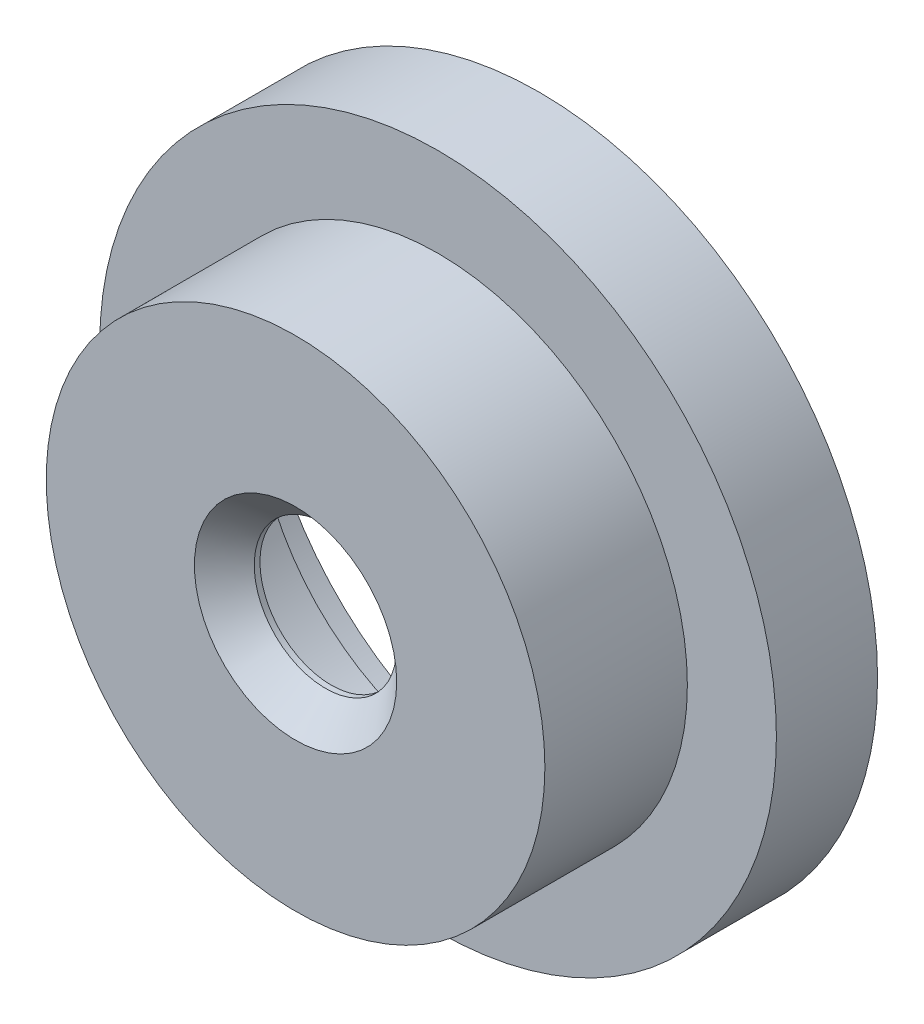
ISO-10303-21;
HEADER;
FILE_DESCRIPTION(('STEP AP214'),'2;1');
FILE_NAME('part.step','',(''),(''),'','','');
FILE_SCHEMA(('AUTOMOTIVE_DESIGN { 1 0 10303 214 1 1 1 1 }'));
ENDSEC;
DATA;
#1=APPLICATION_CONTEXT('core data for automotive mechanical design processes');
#2=APPLICATION_PROTOCOL_DEFINITION('international standard','automotive_design',2000,#1);
#3=PRODUCT_CONTEXT('',#1,'mechanical');
#4=PRODUCT('Part','Part','',(#3));
#5=PRODUCT_RELATED_PRODUCT_CATEGORY('part','',(#4));
#6=PRODUCT_DEFINITION_FORMATION('','',#4);
#7=PRODUCT_DEFINITION_CONTEXT('part definition',#1,'design');
#8=PRODUCT_DEFINITION('design','',#6,#7);
#9=PRODUCT_DEFINITION_SHAPE('','',#8);
#10=(LENGTH_UNIT() NAMED_UNIT(*) SI_UNIT(.MILLI.,.METRE.));
#11=(NAMED_UNIT(*) PLANE_ANGLE_UNIT() SI_UNIT($,.RADIAN.));
#12=(NAMED_UNIT(*) SI_UNIT($,.STERADIAN.) SOLID_ANGLE_UNIT());
#13=UNCERTAINTY_MEASURE_WITH_UNIT(LENGTH_MEASURE(1.E-05),#10,'distance_accuracy_value','');
#14=(GEOMETRIC_REPRESENTATION_CONTEXT(3) GLOBAL_UNCERTAINTY_ASSIGNED_CONTEXT((#13)) GLOBAL_UNIT_ASSIGNED_CONTEXT((#10,
#11,#12)) REPRESENTATION_CONTEXT('',''));
#15=CARTESIAN_POINT('',(0.,0.,0.));
#16=DIRECTION('',(0.,0.,1.));
#17=DIRECTION('',(1.,0.,0.));
#18=AXIS2_PLACEMENT_3D('',#15,#16,#17);
#19=CARTESIAN_POINT('',(0.,0.,-12.7));
#20=DIRECTION('',(0.,0.,1.));
#21=DIRECTION('',(1.,0.,0.));
#22=AXIS2_PLACEMENT_3D('',#19,#20,#21);
#23=CYLINDRICAL_SURFACE('',#22,22.225);
#24=CARTESIAN_POINT('',(0.,0.,-12.7));
#25=DIRECTION('',(0.,0.,-1.));
#26=DIRECTION('',(-1.,0.,0.));
#27=AXIS2_PLACEMENT_3D('',#24,#25,#26);
#28=CIRCLE('',#27,22.225);
#29=CARTESIAN_POINT('',(-22.225,0.,-12.7));
#30=VERTEX_POINT('',#29);
#31=EDGE_CURVE('E108',#30,#30,#28,.F.);
#32=ORIENTED_EDGE('',*,*,#31,.T.);
#33=EDGE_LOOP('',(#32));
#34=FACE_BOUND('',#33,.T.);
#35=CARTESIAN_POINT('',(0.,0.,0.));
#36=DIRECTION('',(0.,0.,1.));
#37=DIRECTION('',(1.,0.,0.));
#38=AXIS2_PLACEMENT_3D('',#35,#36,#37);
#39=CIRCLE('',#38,22.225);
#40=CARTESIAN_POINT('',(22.225,0.,0.));
#41=VERTEX_POINT('',#40);
#42=EDGE_CURVE('E113',#41,#41,#39,.T.);
#43=ORIENTED_EDGE('',*,*,#42,.F.);
#44=EDGE_LOOP('',(#43));
#45=FACE_BOUND('',#44,.T.);
#46=ADVANCED_FACE('F37',(#34,#45),#23,.T.);
#47=CARTESIAN_POINT('',(0.,0.,0.));
#48=DIRECTION('',(0.,0.,1.));
#49=DIRECTION('',(1.,0.,0.));
#50=AXIS2_PLACEMENT_3D('',#47,#48,#49);
#51=PLANE('',#50);
#52=CARTESIAN_POINT('',(0.,0.,0.));
#53=DIRECTION('',(0.,0.,1.));
#54=DIRECTION('',(1.,0.,0.));
#55=AXIS2_PLACEMENT_3D('',#52,#53,#54);
#56=CIRCLE('',#55,9.017);
#57=CARTESIAN_POINT('',(9.017,0.,0.));
#58=VERTEX_POINT('',#57);
#59=EDGE_CURVE('E11',#58,#58,#56,.F.);
#60=ORIENTED_EDGE('',*,*,#59,.T.);
#61=EDGE_LOOP('',(#60));
#62=FACE_BOUND('',#61,.T.);
#63=ORIENTED_EDGE('',*,*,#42,.T.);
#64=EDGE_LOOP('',(#63));
#65=FACE_BOUND('',#64,.T.);
#66=ADVANCED_FACE('F136',(#62,#65),#51,.T.);
#67=CARTESIAN_POINT('',(0.,0.,-21.717));
#68=DIRECTION('',(0.,0.,1.));
#69=DIRECTION('',(1.,0.,0.));
#70=AXIS2_PLACEMENT_3D('',#67,#68,#69);
#71=CYLINDRICAL_SURFACE('',#70,30.1625);
#72=CARTESIAN_POINT('',(0.,0.,-21.717));
#73=DIRECTION('',(0.,0.,-1.));
#74=DIRECTION('',(-1.,0.,0.));
#75=AXIS2_PLACEMENT_3D('',#72,#73,#74);
#76=CIRCLE('',#75,30.1625);
#77=CARTESIAN_POINT('',(-30.1625,0.,-21.717));
#78=VERTEX_POINT('',#77);
#79=EDGE_CURVE('E105',#78,#78,#76,.T.);
#80=ORIENTED_EDGE('',*,*,#79,.F.);
#81=EDGE_LOOP('',(#80));
#82=FACE_BOUND('',#81,.T.);
#83=CARTESIAN_POINT('',(0.,0.,-12.7));
#84=DIRECTION('',(0.,0.,-1.));
#85=DIRECTION('',(-1.,0.,0.));
#86=AXIS2_PLACEMENT_3D('',#83,#84,#85);
#87=CIRCLE('',#86,30.1625);
#88=CARTESIAN_POINT('',(-30.1625,0.,-12.7));
#89=VERTEX_POINT('',#88);
#90=EDGE_CURVE('E102',#89,#89,#87,.T.);
#91=ORIENTED_EDGE('',*,*,#90,.T.);
#92=EDGE_LOOP('',(#91));
#93=FACE_BOUND('',#92,.T.);
#94=ADVANCED_FACE('F141',(#82,#93),#71,.T.);
#95=CARTESIAN_POINT('',(0.,0.,-21.717));
#96=DIRECTION('',(0.,0.,-1.));
#97=DIRECTION('',(-1.,0.,0.));
#98=AXIS2_PLACEMENT_3D('',#95,#96,#97);
#99=PLANE('',#98);
#100=CARTESIAN_POINT('',(0.,27.7114,-21.717));
#101=DIRECTION('',(0.,0.,-1.));
#102=DIRECTION('',(-1.,0.,0.));
#103=AXIS2_PLACEMENT_3D('',#100,#101,#102);
#104=CIRCLE('',#103,1.1303);
#105=CARTESIAN_POINT('',(-1.1303,27.7114,-21.717));
#106=VERTEX_POINT('',#105);
#107=EDGE_CURVE('E69',#106,#106,#104,.T.);
#108=ORIENTED_EDGE('',*,*,#107,.F.);
#109=EDGE_LOOP('',(#108));
#110=FACE_BOUND('',#109,.T.);
#111=CARTESIAN_POINT('',(-27.7114,0.,-21.717));
#112=DIRECTION('',(0.,0.,-1.));
#113=DIRECTION('',(-1.,0.,0.));
#114=AXIS2_PLACEMENT_3D('',#111,#112,#113);
#115=CIRCLE('',#114,1.1303);
#116=CARTESIAN_POINT('',(-28.8417,0.,-21.717));
#117=VERTEX_POINT('',#116);
#118=EDGE_CURVE('E68',#117,#117,#115,.T.);
#119=ORIENTED_EDGE('',*,*,#118,.F.);
#120=EDGE_LOOP('',(#119));
#121=FACE_BOUND('',#120,.T.);
#122=CARTESIAN_POINT('',(0.,-27.7114,-21.717));
#123=DIRECTION('',(0.,0.,-1.));
#124=DIRECTION('',(-1.,0.,0.));
#125=AXIS2_PLACEMENT_3D('',#122,#123,#124);
#126=CIRCLE('',#125,1.1303);
#127=CARTESIAN_POINT('',(-1.1303,-27.7114,-21.717));
#128=VERTEX_POINT('',#127);
#129=EDGE_CURVE('E79',#128,#128,#126,.T.);
#130=ORIENTED_EDGE('',*,*,#129,.F.);
#131=EDGE_LOOP('',(#130));
#132=FACE_BOUND('',#131,.T.);
#133=CARTESIAN_POINT('',(27.7114,0.,-21.717));
#134=DIRECTION('',(0.,0.,-1.));
#135=DIRECTION('',(-1.,0.,0.));
#136=AXIS2_PLACEMENT_3D('',#133,#134,#135);
#137=CIRCLE('',#136,1.1303);
#138=CARTESIAN_POINT('',(26.5811,0.,-21.717));
#139=VERTEX_POINT('',#138);
#140=EDGE_CURVE('E85',#139,#139,#137,.T.);
#141=ORIENTED_EDGE('',*,*,#140,.F.);
#142=EDGE_LOOP('',(#141));
#143=FACE_BOUND('',#142,.T.);
#144=CARTESIAN_POINT('',(0.,0.,-21.717));
#145=DIRECTION('',(0.,0.,-1.));
#146=DIRECTION('',(-1.,0.,0.));
#147=AXIS2_PLACEMENT_3D('',#144,#145,#146);
#148=CIRCLE('',#147,25.273);
#149=CARTESIAN_POINT('',(-25.273,0.,-21.717));
#150=VERTEX_POINT('',#149);
#151=EDGE_CURVE('E95',#150,#150,#148,.T.);
#152=ORIENTED_EDGE('',*,*,#151,.F.);
#153=EDGE_LOOP('',(#152));
#154=FACE_BOUND('',#153,.T.);
#155=ORIENTED_EDGE('',*,*,#79,.T.);
#156=EDGE_LOOP('',(#155));
#157=FACE_BOUND('',#156,.T.);
#158=ADVANCED_FACE('F148',(#110,#121,#132,#143,#154,#157),#99,.T.);
#159=CARTESIAN_POINT('',(0.,0.,-12.7));
#160=DIRECTION('',(0.,0.,-1.));
#161=DIRECTION('',(-1.,0.,0.));
#162=AXIS2_PLACEMENT_3D('',#159,#160,#161);
#163=PLANE('',#162);
#164=ORIENTED_EDGE('',*,*,#31,.F.);
#165=EDGE_LOOP('',(#164));
#166=FACE_BOUND('',#165,.T.);
#167=ORIENTED_EDGE('',*,*,#90,.F.);
#168=EDGE_LOOP('',(#167));
#169=FACE_BOUND('',#168,.T.);
#170=ADVANCED_FACE('F150',(#166,#169),#163,.F.);
#171=CARTESIAN_POINT('',(0.,0.,-15.875));
#172=DIRECTION('',(0.,0.,-1.));
#173=DIRECTION('',(-1.,0.,0.));
#174=AXIS2_PLACEMENT_3D('',#171,#172,#173);
#175=CYLINDRICAL_SURFACE('',#174,25.273);
#176=CARTESIAN_POINT('',(0.,0.,-15.875));
#177=DIRECTION('',(0.,0.,-1.));
#178=DIRECTION('',(-1.,0.,0.));
#179=AXIS2_PLACEMENT_3D('',#176,#177,#178);
#180=CIRCLE('',#179,25.273);
#181=CARTESIAN_POINT('',(-25.273,0.,-15.875));
#182=VERTEX_POINT('',#181);
#183=EDGE_CURVE('E99',#182,#182,#180,.T.);
#184=ORIENTED_EDGE('',*,*,#183,.F.);
#185=EDGE_LOOP('',(#184));
#186=FACE_BOUND('',#185,.T.);
#187=ORIENTED_EDGE('',*,*,#151,.T.);
#188=EDGE_LOOP('',(#187));
#189=FACE_BOUND('',#188,.T.);
#190=ADVANCED_FACE('F153',(#186,#189),#175,.F.);
#191=CARTESIAN_POINT('',(0.,0.,-15.875));
#192=DIRECTION('',(0.,0.,-1.));
#193=DIRECTION('',(-1.,0.,0.));
#194=AXIS2_PLACEMENT_3D('',#191,#192,#193);
#195=PLANE('',#194);
#196=CARTESIAN_POINT('',(0.,0.,-15.875));
#197=DIRECTION('',(0.,0.,-1.));
#198=DIRECTION('',(-1.,0.,0.));
#199=AXIS2_PLACEMENT_3D('',#196,#197,#198);
#200=CIRCLE('',#199,19.431);
#201=CARTESIAN_POINT('',(-19.431,0.,-15.875));
#202=VERTEX_POINT('',#201);
#203=EDGE_CURVE('E96',#202,#202,#200,.T.);
#204=ORIENTED_EDGE('',*,*,#203,.F.);
#205=EDGE_LOOP('',(#204));
#206=FACE_BOUND('',#205,.T.);
#207=ORIENTED_EDGE('',*,*,#183,.T.);
#208=EDGE_LOOP('',(#207));
#209=FACE_BOUND('',#208,.T.);
#210=ADVANCED_FACE('F160',(#206,#209),#195,.T.);
#211=CARTESIAN_POINT('',(0.,0.,-3.175));
#212=DIRECTION('',(0.,0.,-1.));
#213=DIRECTION('',(-1.,0.,0.));
#214=AXIS2_PLACEMENT_3D('',#211,#212,#213);
#215=CYLINDRICAL_SURFACE('',#214,19.431);
#216=CARTESIAN_POINT('',(0.,0.,-3.175));
#217=DIRECTION('',(0.,0.,-1.));
#218=DIRECTION('',(-1.,0.,0.));
#219=AXIS2_PLACEMENT_3D('',#216,#217,#218);
#220=CIRCLE('',#219,19.431);
#221=CARTESIAN_POINT('',(-19.431,0.,-3.175));
#222=VERTEX_POINT('',#221);
#223=EDGE_CURVE('E92',#222,#222,#220,.T.);
#224=ORIENTED_EDGE('',*,*,#223,.F.);
#225=EDGE_LOOP('',(#224));
#226=FACE_BOUND('',#225,.T.);
#227=ORIENTED_EDGE('',*,*,#203,.T.);
#228=EDGE_LOOP('',(#227));
#229=FACE_BOUND('',#228,.T.);
#230=ADVANCED_FACE('F164',(#226,#229),#215,.F.);
#231=CARTESIAN_POINT('',(0.,0.,-3.175));
#232=DIRECTION('',(0.,0.,-1.));
#233=DIRECTION('',(-1.,0.,0.));
#234=AXIS2_PLACEMENT_3D('',#231,#232,#233);
#235=PLANE('',#234);
#236=CARTESIAN_POINT('',(0.,0.,-3.175));
#237=DIRECTION('',(0.,0.,-1.));
#238=DIRECTION('',(-1.,0.,0.));
#239=AXIS2_PLACEMENT_3D('',#236,#237,#238);
#240=CIRCLE('',#239,6.34999999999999);
#241=CARTESIAN_POINT('',(-6.34999999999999,0.,-3.175));
#242=VERTEX_POINT('',#241);
#243=EDGE_CURVE('E91',#242,#242,#240,.T.);
#244=ORIENTED_EDGE('',*,*,#243,.F.);
#245=EDGE_LOOP('',(#244));
#246=FACE_BOUND('',#245,.T.);
#247=ORIENTED_EDGE('',*,*,#223,.T.);
#248=EDGE_LOOP('',(#247));
#249=FACE_BOUND('',#248,.T.);
#250=ADVANCED_FACE('F132',(#246,#249),#235,.T.);
#251=CARTESIAN_POINT('',(0.,0.,0.));
#252=DIRECTION('',(0.,0.,1.));
#253=DIRECTION('',(1.,0.,0.));
#254=AXIS2_PLACEMENT_3D('',#251,#252,#253);
#255=CYLINDRICAL_SURFACE('',#254,6.34999999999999);
#256=CARTESIAN_POINT('',(0.,0.,-2.66700000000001));
#257=DIRECTION('',(0.,0.,1.));
#258=DIRECTION('',(1.,0.,0.));
#259=AXIS2_PLACEMENT_3D('',#256,#257,#258);
#260=CIRCLE('',#259,6.34999999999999);
#261=CARTESIAN_POINT('',(6.34999999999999,0.,-2.66700000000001));
#262=VERTEX_POINT('',#261);
#263=EDGE_CURVE('E45',#262,#262,#260,.T.);
#264=ORIENTED_EDGE('',*,*,#263,.T.);
#265=EDGE_LOOP('',(#264));
#266=FACE_BOUND('',#265,.T.);
#267=ORIENTED_EDGE('',*,*,#243,.T.);
#268=EDGE_LOOP('',(#267));
#269=FACE_BOUND('',#268,.T.);
#270=ADVANCED_FACE('F120',(#266,#269),#255,.F.);
#271=CARTESIAN_POINT('',(0.,0.,-2.66700000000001));
#272=DIRECTION('',(0.,0.,1.));
#273=DIRECTION('',(1.,0.,0.));
#274=AXIS2_PLACEMENT_3D('',#271,#272,#273);
#275=CONICAL_SURFACE('',#274,6.34999999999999,0.785398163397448);
#276=ORIENTED_EDGE('',*,*,#59,.F.);
#277=EDGE_LOOP('',(#276));
#278=FACE_BOUND('',#277,.T.);
#279=ORIENTED_EDGE('',*,*,#263,.F.);
#280=EDGE_LOOP('',(#279));
#281=FACE_BOUND('',#280,.T.);
#282=ADVANCED_FACE('F39',(#278,#281),#275,.F.);
#283=CARTESIAN_POINT('',(27.7114,0.,-15.367));
#284=DIRECTION('',(0.,0.,-1.));
#285=DIRECTION('',(-1.,0.,0.));
#286=AXIS2_PLACEMENT_3D('',#283,#284,#285);
#287=CONICAL_SURFACE('',#286,1.1303,1.02974425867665);
#288=CARTESIAN_POINT('',(27.7114,0.,-14.6878472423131));
#289=VERTEX_POINT('',#288);
#290=VERTEX_LOOP('',#289);
#291=FACE_BOUND('',#290,.T.);
#292=CARTESIAN_POINT('',(27.7114,0.,-15.367));
#293=DIRECTION('',(0.,0.,-1.));
#294=DIRECTION('',(-1.,0.,0.));
#295=AXIS2_PLACEMENT_3D('',#292,#293,#294);
#296=CIRCLE('',#295,1.1303);
#297=CARTESIAN_POINT('',(26.5811,0.,-15.367));
#298=VERTEX_POINT('',#297);
#299=EDGE_CURVE('E88',#298,#298,#296,.T.);
#300=ORIENTED_EDGE('',*,*,#299,.T.);
#301=EDGE_LOOP('',(#300));
#302=FACE_BOUND('',#301,.T.);
#303=ADVANCED_FACE('F124',(#291,#302),#287,.F.);
#304=CARTESIAN_POINT('',(27.7114,0.,-21.717));
#305=DIRECTION('',(0.,0.,-1.));
#306=DIRECTION('',(-1.,0.,0.));
#307=AXIS2_PLACEMENT_3D('',#304,#305,#306);
#308=CYLINDRICAL_SURFACE('',#307,1.1303);
#309=ORIENTED_EDGE('',*,*,#299,.F.);
#310=EDGE_LOOP('',(#309));
#311=FACE_BOUND('',#310,.T.);
#312=ORIENTED_EDGE('',*,*,#140,.T.);
#313=EDGE_LOOP('',(#312));
#314=FACE_BOUND('',#313,.T.);
#315=ADVANCED_FACE('F130',(#311,#314),#308,.F.);
#316=CARTESIAN_POINT('',(0.,-27.7114,-15.367));
#317=DIRECTION('',(0.,0.,-1.));
#318=DIRECTION('',(-1.,0.,0.));
#319=AXIS2_PLACEMENT_3D('',#316,#317,#318);
#320=CONICAL_SURFACE('',#319,1.1303,1.02974425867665);
#321=CARTESIAN_POINT('',(0.,-27.7114,-14.6878472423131));
#322=VERTEX_POINT('',#321);
#323=VERTEX_LOOP('',#322);
#324=FACE_BOUND('',#323,.T.);
#325=CARTESIAN_POINT('',(0.,-27.7114,-15.367));
#326=DIRECTION('',(0.,0.,-1.));
#327=DIRECTION('',(-1.,0.,0.));
#328=AXIS2_PLACEMENT_3D('',#325,#326,#327);
#329=CIRCLE('',#328,1.1303);
#330=CARTESIAN_POINT('',(-1.1303,-27.7114,-15.367));
#331=VERTEX_POINT('',#330);
#332=EDGE_CURVE('E82',#331,#331,#329,.T.);
#333=ORIENTED_EDGE('',*,*,#332,.T.);
#334=EDGE_LOOP('',(#333));
#335=FACE_BOUND('',#334,.T.);
#336=ADVANCED_FACE('F174',(#324,#335),#320,.F.);
#337=CARTESIAN_POINT('',(0.,-27.7114,-21.717));
#338=DIRECTION('',(0.,0.,-1.));
#339=DIRECTION('',(-1.,0.,0.));
#340=AXIS2_PLACEMENT_3D('',#337,#338,#339);
#341=CYLINDRICAL_SURFACE('',#340,1.1303);
#342=ORIENTED_EDGE('',*,*,#332,.F.);
#343=EDGE_LOOP('',(#342));
#344=FACE_BOUND('',#343,.T.);
#345=ORIENTED_EDGE('',*,*,#129,.T.);
#346=EDGE_LOOP('',(#345));
#347=FACE_BOUND('',#346,.T.);
#348=ADVANCED_FACE('F178',(#344,#347),#341,.F.);
#349=CARTESIAN_POINT('',(-27.7114,0.,-15.367));
#350=DIRECTION('',(0.,0.,-1.));
#351=DIRECTION('',(-1.,0.,0.));
#352=AXIS2_PLACEMENT_3D('',#349,#350,#351);
#353=CONICAL_SURFACE('',#352,1.1303,1.02974425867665);
#354=CARTESIAN_POINT('',(-27.7114,0.,-14.6878472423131));
#355=VERTEX_POINT('',#354);
#356=VERTEX_LOOP('',#355);
#357=FACE_BOUND('',#356,.T.);
#358=CARTESIAN_POINT('',(-27.7114,0.,-15.367));
#359=DIRECTION('',(0.,0.,-1.));
#360=DIRECTION('',(-1.,0.,0.));
#361=AXIS2_PLACEMENT_3D('',#358,#359,#360);
#362=CIRCLE('',#361,1.1303);
#363=CARTESIAN_POINT('',(-28.8417,0.,-15.367));
#364=VERTEX_POINT('',#363);
#365=EDGE_CURVE('E72',#364,#364,#362,.T.);
#366=ORIENTED_EDGE('',*,*,#365,.T.);
#367=EDGE_LOOP('',(#366));
#368=FACE_BOUND('',#367,.T.);
#369=ADVANCED_FACE('F181',(#357,#368),#353,.F.);
#370=CARTESIAN_POINT('',(-27.7114,0.,-21.717));
#371=DIRECTION('',(0.,0.,-1.));
#372=DIRECTION('',(-1.,0.,0.));
#373=AXIS2_PLACEMENT_3D('',#370,#371,#372);
#374=CYLINDRICAL_SURFACE('',#373,1.1303);
#375=ORIENTED_EDGE('',*,*,#365,.F.);
#376=EDGE_LOOP('',(#375));
#377=FACE_BOUND('',#376,.T.);
#378=ORIENTED_EDGE('',*,*,#118,.T.);
#379=EDGE_LOOP('',(#378));
#380=FACE_BOUND('',#379,.T.);
#381=ADVANCED_FACE('F62',(#377,#380),#374,.F.);
#382=CARTESIAN_POINT('',(0.,27.7114,-15.367));
#383=DIRECTION('',(0.,0.,-1.));
#384=DIRECTION('',(-1.,0.,0.));
#385=AXIS2_PLACEMENT_3D('',#382,#383,#384);
#386=CONICAL_SURFACE('',#385,1.1303,1.02974425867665);
#387=CARTESIAN_POINT('',(0.,27.7114,-14.6878472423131));
#388=VERTEX_POINT('',#387);
#389=VERTEX_LOOP('',#388);
#390=FACE_BOUND('',#389,.T.);
#391=CARTESIAN_POINT('',(0.,27.7114,-15.367));
#392=DIRECTION('',(0.,0.,-1.));
#393=DIRECTION('',(-1.,0.,0.));
#394=AXIS2_PLACEMENT_3D('',#391,#392,#393);
#395=CIRCLE('',#394,1.1303);
#396=CARTESIAN_POINT('',(-1.1303,27.7114,-15.367));
#397=VERTEX_POINT('',#396);
#398=EDGE_CURVE('E66',#397,#397,#395,.T.);
#399=ORIENTED_EDGE('',*,*,#398,.T.);
#400=EDGE_LOOP('',(#399));
#401=FACE_BOUND('',#400,.T.);
#402=ADVANCED_FACE('F58',(#390,#401),#386,.F.);
#403=CARTESIAN_POINT('',(0.,27.7114,-21.717));
#404=DIRECTION('',(0.,0.,-1.));
#405=DIRECTION('',(-1.,0.,0.));
#406=AXIS2_PLACEMENT_3D('',#403,#404,#405);
#407=CYLINDRICAL_SURFACE('',#406,1.1303);
#408=ORIENTED_EDGE('',*,*,#398,.F.);
#409=EDGE_LOOP('',(#408));
#410=FACE_BOUND('',#409,.T.);
#411=ORIENTED_EDGE('',*,*,#107,.T.);
#412=EDGE_LOOP('',(#411));
#413=FACE_BOUND('',#412,.T.);
#414=ADVANCED_FACE('F61',(#410,#413),#407,.F.);
#415=CLOSED_SHELL('',(#46,#66,#94,#158,#170,#190,#210,#230,#250,#270,#282,#303,#315,#336,#348,
#369,#381,#402,#414));
#416=MANIFOLD_SOLID_BREP('B2',#415);
#417=ADVANCED_BREP_SHAPE_REPRESENTATION('',(#18,#416),#14);
#418=SHAPE_DEFINITION_REPRESENTATION(#9,#417);
ENDSEC;
END-ISO-10303-21;
